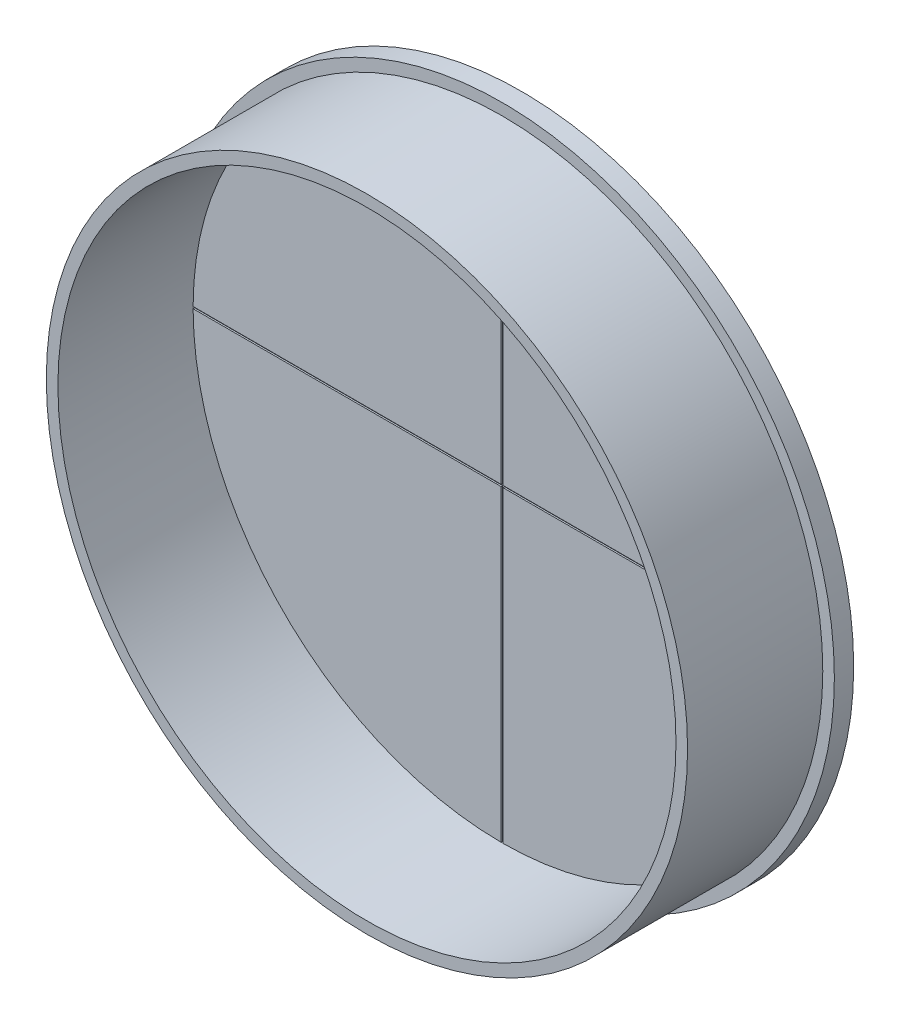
ISO-10303-21;
HEADER;
FILE_DESCRIPTION(('STEP AP214'),'2;1');
FILE_NAME('part.step','',(''),(''),'','','');
FILE_SCHEMA(('AUTOMOTIVE_DESIGN { 1 0 10303 214 1 1 1 1 }'));
ENDSEC;
DATA;
#1=APPLICATION_CONTEXT('core data for automotive mechanical design processes');
#2=APPLICATION_PROTOCOL_DEFINITION('international standard','automotive_design',2000,#1);
#3=PRODUCT_CONTEXT('',#1,'mechanical');
#4=PRODUCT('Part','Part','',(#3));
#5=PRODUCT_RELATED_PRODUCT_CATEGORY('part','',(#4));
#6=PRODUCT_DEFINITION_FORMATION('','',#4);
#7=PRODUCT_DEFINITION_CONTEXT('part definition',#1,'design');
#8=PRODUCT_DEFINITION('design','',#6,#7);
#9=PRODUCT_DEFINITION_SHAPE('','',#8);
#10=(LENGTH_UNIT() NAMED_UNIT(*) SI_UNIT(.MILLI.,.METRE.));
#11=(NAMED_UNIT(*) PLANE_ANGLE_UNIT() SI_UNIT($,.RADIAN.));
#12=(NAMED_UNIT(*) SI_UNIT($,.STERADIAN.) SOLID_ANGLE_UNIT());
#13=UNCERTAINTY_MEASURE_WITH_UNIT(LENGTH_MEASURE(1.E-05),#10,'distance_accuracy_value','');
#14=(GEOMETRIC_REPRESENTATION_CONTEXT(3) GLOBAL_UNCERTAINTY_ASSIGNED_CONTEXT((#13)) GLOBAL_UNIT_ASSIGNED_CONTEXT((#10,
#11,#12)) REPRESENTATION_CONTEXT('',''));
#15=CARTESIAN_POINT('',(0.,0.,0.));
#16=DIRECTION('',(0.,0.,1.));
#17=DIRECTION('',(1.,0.,0.));
#18=AXIS2_PLACEMENT_3D('',#15,#16,#17);
#19=CARTESIAN_POINT('',(0.,0.,5.));
#20=DIRECTION('',(0.,0.,1.));
#21=DIRECTION('',(1.,0.,0.));
#22=AXIS2_PLACEMENT_3D('',#19,#20,#21);
#23=PLANE('',#22);
#24=DIRECTION('',(-1.,0.,0.));
#25=VECTOR('',#24,1.);
#26=CARTESIAN_POINT('',(0.250000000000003,0.25,5.));
#27=LINE('',#26,#25);
#28=CARTESIAN_POINT('',(79.9996093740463,0.25,5.));
#29=VERTEX_POINT('',#28);
#30=CARTESIAN_POINT('',(0.250000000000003,0.25,5.));
#31=VERTEX_POINT('',#30);
#32=EDGE_CURVE('E267',#29,#31,#27,.T.);
#33=ORIENTED_EDGE('',*,*,#32,.F.);
#34=CARTESIAN_POINT('',(0.,0.,5.));
#35=DIRECTION('',(0.,0.,-1.));
#36=DIRECTION('',(0.00312499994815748,0.999995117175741,0.));
#37=AXIS2_PLACEMENT_3D('',#34,#35,#36);
#38=CIRCLE('',#37,80.);
#39=CARTESIAN_POINT('',(0.250000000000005,79.9996093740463,5.));
#40=VERTEX_POINT('',#39);
#41=EDGE_CURVE('E234',#40,#29,#38,.T.);
#42=ORIENTED_EDGE('',*,*,#41,.F.);
#43=DIRECTION('',(0.,1.,0.));
#44=VECTOR('',#43,1.);
#45=CARTESIAN_POINT('',(0.250000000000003,0.25,5.));
#46=LINE('',#45,#44);
#47=EDGE_CURVE('E269',#31,#40,#46,.T.);
#48=ORIENTED_EDGE('',*,*,#47,.F.);
#49=EDGE_LOOP('',(#33,#42,#48));
#50=FACE_BOUND('',#49,.T.);
#51=ADVANCED_FACE('F33',(#50),#23,.T.);
#52=DIRECTION('',(0.,-1.,0.));
#53=VECTOR('',#52,1.);
#54=CARTESIAN_POINT('',(-0.249999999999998,0.25,5.));
#55=LINE('',#54,#53);
#56=CARTESIAN_POINT('',(-0.249999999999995,79.9996093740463,5.));
#57=VERTEX_POINT('',#56);
#58=CARTESIAN_POINT('',(-0.249999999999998,0.25,5.));
#59=VERTEX_POINT('',#58);
#60=EDGE_CURVE('E396',#57,#59,#55,.T.);
#61=ORIENTED_EDGE('',*,*,#60,.F.);
#62=CARTESIAN_POINT('',(0.,0.,5.));
#63=DIRECTION('',(0.,0.,-1.));
#64=DIRECTION('',(-0.999995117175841,0.00312499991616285,0.));
#65=AXIS2_PLACEMENT_3D('',#62,#63,#64);
#66=CIRCLE('',#65,80.);
#67=CARTESIAN_POINT('',(-79.9996093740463,0.25,5.));
#68=VERTEX_POINT('',#67);
#69=EDGE_CURVE('E390',#68,#57,#66,.T.);
#70=ORIENTED_EDGE('',*,*,#69,.F.);
#71=DIRECTION('',(-1.,0.,0.));
#72=VECTOR('',#71,1.);
#73=CARTESIAN_POINT('',(-79.9996093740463,0.25,5.));
#74=LINE('',#73,#72);
#75=EDGE_CURVE('E394',#59,#68,#74,.T.);
#76=ORIENTED_EDGE('',*,*,#75,.F.);
#77=EDGE_LOOP('',(#61,#70,#76));
#78=FACE_BOUND('',#77,.T.);
#79=ADVANCED_FACE('F260',(#78),#23,.T.);
#80=DIRECTION('',(1.,0.,0.));
#81=VECTOR('',#80,1.);
#82=CARTESIAN_POINT('',(-79.9996093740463,-0.25,5.));
#83=LINE('',#82,#81);
#84=CARTESIAN_POINT('',(-79.9996093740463,-0.25,5.));
#85=VERTEX_POINT('',#84);
#86=CARTESIAN_POINT('',(-0.249999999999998,-0.25,5.));
#87=VERTEX_POINT('',#86);
#88=EDGE_CURVE('E337',#85,#87,#83,.T.);
#89=ORIENTED_EDGE('',*,*,#88,.F.);
#90=CARTESIAN_POINT('',(0.,0.,5.));
#91=DIRECTION('',(0.,0.,-1.));
#92=DIRECTION('',(-0.00312499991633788,-0.99999511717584,0.));
#93=AXIS2_PLACEMENT_3D('',#90,#91,#92);
#94=CIRCLE('',#93,80.);
#95=CARTESIAN_POINT('',(-0.249999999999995,-79.9996093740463,5.));
#96=VERTEX_POINT('',#95);
#97=EDGE_CURVE('E43',#96,#85,#94,.T.);
#98=ORIENTED_EDGE('',*,*,#97,.F.);
#99=DIRECTION('',(0.,-1.,0.));
#100=VECTOR('',#99,1.);
#101=CARTESIAN_POINT('',(-0.249999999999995,-79.9996093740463,5.));
#102=LINE('',#101,#100);
#103=EDGE_CURVE('E342',#87,#96,#102,.T.);
#104=ORIENTED_EDGE('',*,*,#103,.F.);
#105=EDGE_LOOP('',(#89,#98,#104));
#106=FACE_BOUND('',#105,.T.);
#107=ADVANCED_FACE('F264',(#106),#23,.T.);
#108=CARTESIAN_POINT('',(0.,0.,5.));
#109=DIRECTION('',(0.,0.,-1.));
#110=DIRECTION('',(-1.,0.,0.));
#111=AXIS2_PLACEMENT_3D('',#108,#109,#110);
#112=CYLINDRICAL_SURFACE('',#111,86.);
#113=CARTESIAN_POINT('',(0.,0.,5.));
#114=DIRECTION('',(0.,0.,1.));
#115=DIRECTION('',(1.,0.,0.));
#116=AXIS2_PLACEMENT_3D('',#113,#114,#115);
#117=CIRCLE('',#116,86.);
#118=CARTESIAN_POINT('',(86.,0.,5.));
#119=VERTEX_POINT('',#118);
#120=EDGE_CURVE('E370',#119,#119,#117,.T.);
#121=ORIENTED_EDGE('',*,*,#120,.F.);
#122=EDGE_LOOP('',(#121));
#123=FACE_BOUND('',#122,.T.);
#124=CARTESIAN_POINT('',(0.,0.,0.));
#125=DIRECTION('',(0.,0.,1.));
#126=DIRECTION('',(1.,0.,0.));
#127=AXIS2_PLACEMENT_3D('',#124,#125,#126);
#128=CIRCLE('',#127,86.);
#129=CARTESIAN_POINT('',(86.,0.,0.));
#130=VERTEX_POINT('',#129);
#131=EDGE_CURVE('E367',#130,#130,#128,.T.);
#132=ORIENTED_EDGE('',*,*,#131,.T.);
#133=EDGE_LOOP('',(#132));
#134=FACE_BOUND('',#133,.T.);
#135=ADVANCED_FACE('F35',(#123,#134),#112,.T.);
#136=CARTESIAN_POINT('',(0.,0.,5.));
#137=DIRECTION('',(0.,0.,1.));
#138=DIRECTION('',(1.,0.,0.));
#139=AXIS2_PLACEMENT_3D('',#136,#137,#138);
#140=CIRCLE('',#139,83.);
#141=CARTESIAN_POINT('',(83.,0.,5.));
#142=VERTEX_POINT('',#141);
#143=EDGE_CURVE('E363',#142,#142,#140,.T.);
#144=ORIENTED_EDGE('',*,*,#143,.F.);
#145=EDGE_LOOP('',(#144));
#146=FACE_BOUND('',#145,.T.);
#147=ORIENTED_EDGE('',*,*,#120,.T.);
#148=EDGE_LOOP('',(#147));
#149=FACE_BOUND('',#148,.T.);
#150=ADVANCED_FACE('F242',(#146,#149),#23,.T.);
#151=CARTESIAN_POINT('',(0.,0.,0.));
#152=DIRECTION('',(0.,0.,1.));
#153=DIRECTION('',(1.,0.,0.));
#154=AXIS2_PLACEMENT_3D('',#151,#152,#153);
#155=PLANE('',#154);
#156=ORIENTED_EDGE('',*,*,#131,.F.);
#157=EDGE_LOOP('',(#156));
#158=FACE_BOUND('',#157,.T.);
#159=ADVANCED_FACE('F250',(#158),#155,.F.);
#160=CARTESIAN_POINT('',(0.,0.,40.));
#161=DIRECTION('',(0.,0.,1.));
#162=DIRECTION('',(1.,0.,0.));
#163=AXIS2_PLACEMENT_3D('',#160,#161,#162);
#164=PLANE('',#163);
#165=CARTESIAN_POINT('',(0.,0.,40.));
#166=DIRECTION('',(0.,0.,1.));
#167=DIRECTION('',(1.,0.,0.));
#168=AXIS2_PLACEMENT_3D('',#165,#166,#167);
#169=CIRCLE('',#168,83.);
#170=CARTESIAN_POINT('',(83.,0.,40.));
#171=VERTEX_POINT('',#170);
#172=EDGE_CURVE('E364',#171,#171,#169,.T.);
#173=ORIENTED_EDGE('',*,*,#172,.T.);
#174=EDGE_LOOP('',(#173));
#175=FACE_BOUND('',#174,.T.);
#176=CARTESIAN_POINT('',(0.,0.,40.));
#177=DIRECTION('',(0.,0.,1.));
#178=DIRECTION('',(1.,0.,0.));
#179=AXIS2_PLACEMENT_3D('',#176,#177,#178);
#180=CIRCLE('',#179,80.);
#181=CARTESIAN_POINT('',(80.,0.,40.));
#182=VERTEX_POINT('',#181);
#183=EDGE_CURVE('E360',#182,#182,#180,.T.);
#184=ORIENTED_EDGE('',*,*,#183,.F.);
#185=EDGE_LOOP('',(#184));
#186=FACE_BOUND('',#185,.T.);
#187=ADVANCED_FACE('F198',(#175,#186),#164,.T.);
#188=CARTESIAN_POINT('',(0.,0.,40.));
#189=DIRECTION('',(0.,0.,-1.));
#190=DIRECTION('',(-1.,0.,0.));
#191=AXIS2_PLACEMENT_3D('',#188,#189,#190);
#192=CYLINDRICAL_SURFACE('',#191,83.);
#193=ORIENTED_EDGE('',*,*,#172,.F.);
#194=EDGE_LOOP('',(#193));
#195=FACE_BOUND('',#194,.T.);
#196=ORIENTED_EDGE('',*,*,#143,.T.);
#197=EDGE_LOOP('',(#196));
#198=FACE_BOUND('',#197,.T.);
#199=ADVANCED_FACE('F196',(#195,#198),#192,.T.);
#200=CARTESIAN_POINT('',(0.,0.,40.));
#201=DIRECTION('',(0.,0.,-1.));
#202=DIRECTION('',(-1.,0.,0.));
#203=AXIS2_PLACEMENT_3D('',#200,#201,#202);
#204=CYLINDRICAL_SURFACE('',#203,80.);
#205=ORIENTED_EDGE('',*,*,#183,.T.);
#206=EDGE_LOOP('',(#205));
#207=FACE_BOUND('',#206,.T.);
#208=CARTESIAN_POINT('',(0.,0.,5.));
#209=DIRECTION('',(0.,0.,-1.));
#210=DIRECTION('',(0.999995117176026,-0.00312499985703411,0.));
#211=AXIS2_PLACEMENT_3D('',#208,#209,#210);
#212=CIRCLE('',#211,80.);
#213=CARTESIAN_POINT('',(79.9996093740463,-0.25,5.));
#214=VERTEX_POINT('',#213);
#215=CARTESIAN_POINT('',(0.250000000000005,-79.9996093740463,5.));
#216=VERTEX_POINT('',#215);
#217=EDGE_CURVE('E11',#214,#216,#212,.T.);
#218=ORIENTED_EDGE('',*,*,#217,.T.);
#219=CARTESIAN_POINT('',(-0.249999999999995,-79.9996093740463,5.));
#220=DIRECTION('',(1.,0.,0.));
#221=VECTOR('',#220,1.);
#222=LINE('',#219,#221);
#223=EDGE_CURVE('E136',#96,#216,#222,.T.);
#224=ORIENTED_EDGE('',*,*,#223,.F.);
#225=ORIENTED_EDGE('',*,*,#97,.T.);
#226=CARTESIAN_POINT('',(-79.9996093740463,0.25,5.));
#227=DIRECTION('',(0.,-1.,0.));
#228=VECTOR('',#227,1.);
#229=LINE('',#226,#228);
#230=EDGE_CURVE('E389',#68,#85,#229,.T.);
#231=ORIENTED_EDGE('',*,*,#230,.F.);
#232=ORIENTED_EDGE('',*,*,#69,.T.);
#233=CARTESIAN_POINT('',(0.250000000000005,79.9996093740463,5.));
#234=DIRECTION('',(-1.,0.,0.));
#235=VECTOR('',#234,1.);
#236=LINE('',#233,#235);
#237=EDGE_CURVE('E272',#40,#57,#236,.T.);
#238=ORIENTED_EDGE('',*,*,#237,.F.);
#239=ORIENTED_EDGE('',*,*,#41,.T.);
#240=CARTESIAN_POINT('',(79.9996093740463,-0.25,5.));
#241=DIRECTION('',(0.,1.,0.));
#242=VECTOR('',#241,1.);
#243=LINE('',#240,#242);
#244=EDGE_CURVE('E171',#214,#29,#243,.T.);
#245=ORIENTED_EDGE('',*,*,#244,.F.);
#246=EDGE_LOOP('',(#218,#224,#225,#231,#232,#238,#239,#245));
#247=FACE_BOUND('',#246,.T.);
#248=ADVANCED_FACE('F192',(#207,#247),#204,.F.);
#249=DIRECTION('',(0.,1.,0.));
#250=VECTOR('',#249,1.);
#251=CARTESIAN_POINT('',(0.250000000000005,-79.9996093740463,5.));
#252=LINE('',#251,#250);
#253=CARTESIAN_POINT('',(0.250000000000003,-0.25,5.));
#254=VERTEX_POINT('',#253);
#255=EDGE_CURVE('E50',#216,#254,#252,.T.);
#256=ORIENTED_EDGE('',*,*,#255,.F.);
#257=ORIENTED_EDGE('',*,*,#217,.F.);
#258=DIRECTION('',(1.,0.,0.));
#259=VECTOR('',#258,1.);
#260=CARTESIAN_POINT('',(0.250000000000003,-0.25,5.));
#261=LINE('',#260,#259);
#262=EDGE_CURVE('E314',#254,#214,#261,.T.);
#263=ORIENTED_EDGE('',*,*,#262,.F.);
#264=EDGE_LOOP('',(#256,#257,#263));
#265=FACE_BOUND('',#264,.T.);
#266=ADVANCED_FACE('F189',(#265),#23,.T.);
#267=CARTESIAN_POINT('',(79.9996093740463,-0.25,4.6));
#268=DIRECTION('',(1.,0.,0.));
#269=DIRECTION('',(0.,0.,-1.));
#270=AXIS2_PLACEMENT_3D('',#267,#268,#269);
#271=PLANE('',#270);
#272=ORIENTED_EDGE('',*,*,#244,.T.);
#273=DIRECTION('',(0.,0.,1.));
#274=VECTOR('',#273,1.);
#275=CARTESIAN_POINT('',(79.9996093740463,0.25,4.6));
#276=LINE('',#275,#274);
#277=CARTESIAN_POINT('',(79.9996093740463,0.25,4.6));
#278=VERTEX_POINT('',#277);
#279=EDGE_CURVE('E100',#278,#29,#276,.T.);
#280=ORIENTED_EDGE('',*,*,#279,.F.);
#281=DIRECTION('',(0.,1.,0.));
#282=VECTOR('',#281,1.);
#283=CARTESIAN_POINT('',(79.9996093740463,-0.25,4.6));
#284=LINE('',#283,#282);
#285=CARTESIAN_POINT('',(79.9996093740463,-0.25,4.6));
#286=VERTEX_POINT('',#285);
#287=EDGE_CURVE('E312',#286,#278,#284,.T.);
#288=ORIENTED_EDGE('',*,*,#287,.F.);
#289=DIRECTION('',(0.,0.,1.));
#290=VECTOR('',#289,1.);
#291=CARTESIAN_POINT('',(79.9996093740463,-0.25,4.6));
#292=LINE('',#291,#290);
#293=EDGE_CURVE('E59',#286,#214,#292,.T.);
#294=ORIENTED_EDGE('',*,*,#293,.T.);
#295=EDGE_LOOP('',(#272,#280,#288,#294));
#296=FACE_BOUND('',#295,.T.);
#297=ADVANCED_FACE('F178',(#296),#271,.F.);
#298=CARTESIAN_POINT('',(0.250000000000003,-0.25,4.6));
#299=DIRECTION('',(0.,-1.,0.));
#300=DIRECTION('',(1.,0.,0.));
#301=AXIS2_PLACEMENT_3D('',#298,#299,#300);
#302=PLANE('',#301);
#303=ORIENTED_EDGE('',*,*,#262,.T.);
#304=ORIENTED_EDGE('',*,*,#293,.F.);
#305=DIRECTION('',(1.,0.,0.));
#306=VECTOR('',#305,1.);
#307=CARTESIAN_POINT('',(0.250000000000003,-0.25,4.6));
#308=LINE('',#307,#306);
#309=CARTESIAN_POINT('',(0.250000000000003,-0.25,4.6));
#310=VERTEX_POINT('',#309);
#311=EDGE_CURVE('E146',#310,#286,#308,.T.);
#312=ORIENTED_EDGE('',*,*,#311,.F.);
#313=DIRECTION('',(0.,0.,1.));
#314=VECTOR('',#313,1.);
#315=CARTESIAN_POINT('',(0.250000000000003,-0.25,4.6));
#316=LINE('',#315,#314);
#317=EDGE_CURVE('E138',#310,#254,#316,.T.);
#318=ORIENTED_EDGE('',*,*,#317,.T.);
#319=EDGE_LOOP('',(#303,#304,#312,#318));
#320=FACE_BOUND('',#319,.T.);
#321=ADVANCED_FACE('F188',(#320),#302,.F.);
#322=CARTESIAN_POINT('',(0.250000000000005,-79.9996093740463,4.6));
#323=DIRECTION('',(1.,0.,0.));
#324=DIRECTION('',(0.,1.,0.));
#325=AXIS2_PLACEMENT_3D('',#322,#323,#324);
#326=PLANE('',#325);
#327=ORIENTED_EDGE('',*,*,#255,.T.);
#328=ORIENTED_EDGE('',*,*,#317,.F.);
#329=DIRECTION('',(0.,1.,0.));
#330=VECTOR('',#329,1.);
#331=CARTESIAN_POINT('',(0.250000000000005,-79.9996093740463,4.6));
#332=LINE('',#331,#330);
#333=CARTESIAN_POINT('',(0.250000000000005,-79.9996093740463,4.6));
#334=VERTEX_POINT('',#333);
#335=EDGE_CURVE('E142',#334,#310,#332,.T.);
#336=ORIENTED_EDGE('',*,*,#335,.F.);
#337=DIRECTION('',(0.,0.,1.));
#338=VECTOR('',#337,1.);
#339=CARTESIAN_POINT('',(0.250000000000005,-79.9996093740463,4.6));
#340=LINE('',#339,#338);
#341=EDGE_CURVE('E129',#334,#216,#340,.T.);
#342=ORIENTED_EDGE('',*,*,#341,.T.);
#343=EDGE_LOOP('',(#327,#328,#336,#342));
#344=FACE_BOUND('',#343,.T.);
#345=ADVANCED_FACE('F143',(#344),#326,.F.);
#346=CARTESIAN_POINT('',(-0.249999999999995,-79.9996093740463,4.6));
#347=DIRECTION('',(0.,-1.,0.));
#348=DIRECTION('',(0.,0.,-1.));
#349=AXIS2_PLACEMENT_3D('',#346,#347,#348);
#350=PLANE('',#349);
#351=ORIENTED_EDGE('',*,*,#223,.T.);
#352=ORIENTED_EDGE('',*,*,#341,.F.);
#353=DIRECTION('',(1.,0.,0.));
#354=VECTOR('',#353,1.);
#355=CARTESIAN_POINT('',(-0.249999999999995,-79.9996093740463,4.6));
#356=LINE('',#355,#354);
#357=CARTESIAN_POINT('',(-0.249999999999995,-79.9996093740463,4.6));
#358=VERTEX_POINT('',#357);
#359=EDGE_CURVE('E133',#358,#334,#356,.T.);
#360=ORIENTED_EDGE('',*,*,#359,.F.);
#361=DIRECTION('',(0.,0.,1.));
#362=VECTOR('',#361,1.);
#363=CARTESIAN_POINT('',(-0.249999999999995,-79.9996093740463,4.6));
#364=LINE('',#363,#362);
#365=EDGE_CURVE('E139',#358,#96,#364,.T.);
#366=ORIENTED_EDGE('',*,*,#365,.T.);
#367=EDGE_LOOP('',(#351,#352,#360,#366));
#368=FACE_BOUND('',#367,.T.);
#369=ADVANCED_FACE('F131',(#368),#350,.F.);
#370=CARTESIAN_POINT('',(-0.249999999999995,-79.9996093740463,4.6));
#371=DIRECTION('',(-1.,0.,0.));
#372=DIRECTION('',(0.,-1.,0.));
#373=AXIS2_PLACEMENT_3D('',#370,#371,#372);
#374=PLANE('',#373);
#375=ORIENTED_EDGE('',*,*,#103,.T.);
#376=ORIENTED_EDGE('',*,*,#365,.F.);
#377=DIRECTION('',(0.,-1.,0.));
#378=VECTOR('',#377,1.);
#379=CARTESIAN_POINT('',(-0.249999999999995,-79.9996093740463,4.6));
#380=LINE('',#379,#378);
#381=CARTESIAN_POINT('',(-0.249999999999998,-0.25,4.6));
#382=VERTEX_POINT('',#381);
#383=EDGE_CURVE('E152',#382,#358,#380,.T.);
#384=ORIENTED_EDGE('',*,*,#383,.F.);
#385=DIRECTION('',(0.,0.,1.));
#386=VECTOR('',#385,1.);
#387=CARTESIAN_POINT('',(-0.249999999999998,-0.25,4.6));
#388=LINE('',#387,#386);
#389=EDGE_CURVE('E160',#382,#87,#388,.T.);
#390=ORIENTED_EDGE('',*,*,#389,.T.);
#391=EDGE_LOOP('',(#375,#376,#384,#390));
#392=FACE_BOUND('',#391,.T.);
#393=ADVANCED_FACE('F341',(#392),#374,.F.);
#394=CARTESIAN_POINT('',(-79.9996093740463,-0.25,4.6));
#395=DIRECTION('',(0.,-1.,0.));
#396=DIRECTION('',(1.,0.,0.));
#397=AXIS2_PLACEMENT_3D('',#394,#395,#396);
#398=PLANE('',#397);
#399=ORIENTED_EDGE('',*,*,#88,.T.);
#400=ORIENTED_EDGE('',*,*,#389,.F.);
#401=DIRECTION('',(1.,0.,0.));
#402=VECTOR('',#401,1.);
#403=CARTESIAN_POINT('',(-79.9996093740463,-0.25,4.6));
#404=LINE('',#403,#402);
#405=CARTESIAN_POINT('',(-79.9996093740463,-0.25,4.6));
#406=VERTEX_POINT('',#405);
#407=EDGE_CURVE('E154',#406,#382,#404,.T.);
#408=ORIENTED_EDGE('',*,*,#407,.F.);
#409=DIRECTION('',(0.,0.,1.));
#410=VECTOR('',#409,1.);
#411=CARTESIAN_POINT('',(-79.9996093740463,-0.25,4.6));
#412=LINE('',#411,#410);
#413=EDGE_CURVE('E162',#406,#85,#412,.T.);
#414=ORIENTED_EDGE('',*,*,#413,.T.);
#415=EDGE_LOOP('',(#399,#400,#408,#414));
#416=FACE_BOUND('',#415,.T.);
#417=ADVANCED_FACE('F334',(#416),#398,.F.);
#418=CARTESIAN_POINT('',(-79.9996093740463,-0.25,4.6));
#419=DIRECTION('',(-1.,0.,0.));
#420=DIRECTION('',(0.,0.,1.));
#421=AXIS2_PLACEMENT_3D('',#418,#419,#420);
#422=PLANE('',#421);
#423=ORIENTED_EDGE('',*,*,#230,.T.);
#424=ORIENTED_EDGE('',*,*,#413,.F.);
#425=DIRECTION('',(0.,-1.,0.));
#426=VECTOR('',#425,1.);
#427=CARTESIAN_POINT('',(-79.9996093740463,-0.25,4.6));
#428=LINE('',#427,#426);
#429=CARTESIAN_POINT('',(-79.9996093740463,0.25,4.6));
#430=VERTEX_POINT('',#429);
#431=EDGE_CURVE('E328',#430,#406,#428,.T.);
#432=ORIENTED_EDGE('',*,*,#431,.F.);
#433=DIRECTION('',(0.,0.,1.));
#434=VECTOR('',#433,1.);
#435=CARTESIAN_POINT('',(-79.9996093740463,0.25,4.6));
#436=LINE('',#435,#434);
#437=EDGE_CURVE('E165',#430,#68,#436,.T.);
#438=ORIENTED_EDGE('',*,*,#437,.T.);
#439=EDGE_LOOP('',(#423,#424,#432,#438));
#440=FACE_BOUND('',#439,.T.);
#441=ADVANCED_FACE('F413',(#440),#422,.F.);
#442=CARTESIAN_POINT('',(-79.9996093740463,0.25,4.6));
#443=DIRECTION('',(0.,1.,0.));
#444=DIRECTION('',(-1.,0.,0.));
#445=AXIS2_PLACEMENT_3D('',#442,#443,#444);
#446=PLANE('',#445);
#447=ORIENTED_EDGE('',*,*,#75,.T.);
#448=ORIENTED_EDGE('',*,*,#437,.F.);
#449=DIRECTION('',(-1.,0.,0.));
#450=VECTOR('',#449,1.);
#451=CARTESIAN_POINT('',(-79.9996093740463,0.25,4.6));
#452=LINE('',#451,#450);
#453=CARTESIAN_POINT('',(-0.249999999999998,0.25,4.6));
#454=VERTEX_POINT('',#453);
#455=EDGE_CURVE('E325',#454,#430,#452,.T.);
#456=ORIENTED_EDGE('',*,*,#455,.F.);
#457=DIRECTION('',(0.,0.,1.));
#458=VECTOR('',#457,1.);
#459=CARTESIAN_POINT('',(-0.249999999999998,0.25,4.6));
#460=LINE('',#459,#458);
#461=EDGE_CURVE('E163',#454,#59,#460,.T.);
#462=ORIENTED_EDGE('',*,*,#461,.T.);
#463=EDGE_LOOP('',(#447,#448,#456,#462));
#464=FACE_BOUND('',#463,.T.);
#465=ADVANCED_FACE('F422',(#464),#446,.F.);
#466=CARTESIAN_POINT('',(-0.249999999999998,0.25,4.6));
#467=DIRECTION('',(-1.,0.,0.));
#468=DIRECTION('',(0.,-1.,0.));
#469=AXIS2_PLACEMENT_3D('',#466,#467,#468);
#470=PLANE('',#469);
#471=ORIENTED_EDGE('',*,*,#60,.T.);
#472=ORIENTED_EDGE('',*,*,#461,.F.);
#473=DIRECTION('',(0.,-1.,0.));
#474=VECTOR('',#473,1.);
#475=CARTESIAN_POINT('',(-0.249999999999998,0.25,4.6));
#476=LINE('',#475,#474);
#477=CARTESIAN_POINT('',(-0.249999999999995,79.9996093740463,4.6));
#478=VERTEX_POINT('',#477);
#479=EDGE_CURVE('E322',#478,#454,#476,.T.);
#480=ORIENTED_EDGE('',*,*,#479,.F.);
#481=DIRECTION('',(0.,0.,1.));
#482=VECTOR('',#481,1.);
#483=CARTESIAN_POINT('',(-0.249999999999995,79.9996093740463,4.6));
#484=LINE('',#483,#482);
#485=EDGE_CURVE('E166',#478,#57,#484,.T.);
#486=ORIENTED_EDGE('',*,*,#485,.T.);
#487=EDGE_LOOP('',(#471,#472,#480,#486));
#488=FACE_BOUND('',#487,.T.);
#489=ADVANCED_FACE('F299',(#488),#470,.F.);
#490=CARTESIAN_POINT('',(-0.249999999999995,79.9996093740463,4.6));
#491=DIRECTION('',(0.,1.,0.));
#492=DIRECTION('',(0.,0.,1.));
#493=AXIS2_PLACEMENT_3D('',#490,#491,#492);
#494=PLANE('',#493);
#495=ORIENTED_EDGE('',*,*,#237,.T.);
#496=ORIENTED_EDGE('',*,*,#485,.F.);
#497=DIRECTION('',(-1.,0.,0.));
#498=VECTOR('',#497,1.);
#499=CARTESIAN_POINT('',(-0.249999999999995,79.9996093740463,4.6));
#500=LINE('',#499,#498);
#501=CARTESIAN_POINT('',(0.250000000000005,79.9996093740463,4.6));
#502=VERTEX_POINT('',#501);
#503=EDGE_CURVE('E319',#502,#478,#500,.T.);
#504=ORIENTED_EDGE('',*,*,#503,.F.);
#505=DIRECTION('',(0.,0.,1.));
#506=VECTOR('',#505,1.);
#507=CARTESIAN_POINT('',(0.250000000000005,79.9996093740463,4.6));
#508=LINE('',#507,#506);
#509=EDGE_CURVE('E169',#502,#40,#508,.T.);
#510=ORIENTED_EDGE('',*,*,#509,.T.);
#511=EDGE_LOOP('',(#495,#496,#504,#510));
#512=FACE_BOUND('',#511,.T.);
#513=ADVANCED_FACE('F289',(#512),#494,.F.);
#514=CARTESIAN_POINT('',(0.250000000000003,0.25,4.6));
#515=DIRECTION('',(1.,0.,0.));
#516=DIRECTION('',(0.,1.,0.));
#517=AXIS2_PLACEMENT_3D('',#514,#515,#516);
#518=PLANE('',#517);
#519=ORIENTED_EDGE('',*,*,#47,.T.);
#520=ORIENTED_EDGE('',*,*,#509,.F.);
#521=DIRECTION('',(0.,1.,0.));
#522=VECTOR('',#521,1.);
#523=CARTESIAN_POINT('',(0.250000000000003,0.25,4.6));
#524=LINE('',#523,#522);
#525=CARTESIAN_POINT('',(0.250000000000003,0.25,4.6));
#526=VERTEX_POINT('',#525);
#527=EDGE_CURVE('E309',#526,#502,#524,.T.);
#528=ORIENTED_EDGE('',*,*,#527,.F.);
#529=DIRECTION('',(0.,0.,1.));
#530=VECTOR('',#529,1.);
#531=CARTESIAN_POINT('',(0.250000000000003,0.25,4.6));
#532=LINE('',#531,#530);
#533=EDGE_CURVE('E167',#526,#31,#532,.T.);
#534=ORIENTED_EDGE('',*,*,#533,.T.);
#535=EDGE_LOOP('',(#519,#520,#528,#534));
#536=FACE_BOUND('',#535,.T.);
#537=ADVANCED_FACE('F298',(#536),#518,.F.);
#538=CARTESIAN_POINT('',(0.250000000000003,0.25,4.6));
#539=DIRECTION('',(0.,1.,0.));
#540=DIRECTION('',(-1.,0.,0.));
#541=AXIS2_PLACEMENT_3D('',#538,#539,#540);
#542=PLANE('',#541);
#543=ORIENTED_EDGE('',*,*,#32,.T.);
#544=ORIENTED_EDGE('',*,*,#533,.F.);
#545=DIRECTION('',(-1.,0.,0.));
#546=VECTOR('',#545,1.);
#547=CARTESIAN_POINT('',(0.250000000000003,0.25,4.6));
#548=LINE('',#547,#546);
#549=EDGE_CURVE('E311',#278,#526,#548,.T.);
#550=ORIENTED_EDGE('',*,*,#549,.F.);
#551=ORIENTED_EDGE('',*,*,#279,.T.);
#552=EDGE_LOOP('',(#543,#544,#550,#551));
#553=FACE_BOUND('',#552,.T.);
#554=ADVANCED_FACE('F190',(#553),#542,.F.);
#555=CARTESIAN_POINT('',(0.,0.,4.6));
#556=DIRECTION('',(0.,0.,-1.));
#557=DIRECTION('',(-1.,0.,0.));
#558=AXIS2_PLACEMENT_3D('',#555,#556,#557);
#559=PLANE('',#558);
#560=ORIENTED_EDGE('',*,*,#287,.T.);
#561=ORIENTED_EDGE('',*,*,#549,.T.);
#562=ORIENTED_EDGE('',*,*,#527,.T.);
#563=ORIENTED_EDGE('',*,*,#503,.T.);
#564=ORIENTED_EDGE('',*,*,#479,.T.);
#565=ORIENTED_EDGE('',*,*,#455,.T.);
#566=ORIENTED_EDGE('',*,*,#431,.T.);
#567=ORIENTED_EDGE('',*,*,#407,.T.);
#568=ORIENTED_EDGE('',*,*,#383,.T.);
#569=ORIENTED_EDGE('',*,*,#359,.T.);
#570=ORIENTED_EDGE('',*,*,#335,.T.);
#571=ORIENTED_EDGE('',*,*,#311,.T.);
#572=EDGE_LOOP('',(#560,#561,#562,#563,#564,#565,#566,#567,#568,#569,#570,#571));
#573=FACE_BOUND('',#572,.T.);
#574=ADVANCED_FACE('F149',(#573),#559,.F.);
#575=CLOSED_SHELL('',(#51,#79,#107,#135,#150,#159,#187,#199,#248,#266,#297,#321,#345,#369,#393,
#417,#441,#465,#489,#513,#537,#554,#574));
#576=MANIFOLD_SOLID_BREP('B2',#575);
#577=ADVANCED_BREP_SHAPE_REPRESENTATION('',(#18,#576),#14);
#578=SHAPE_DEFINITION_REPRESENTATION(#9,#577);
ENDSEC;
END-ISO-10303-21;
